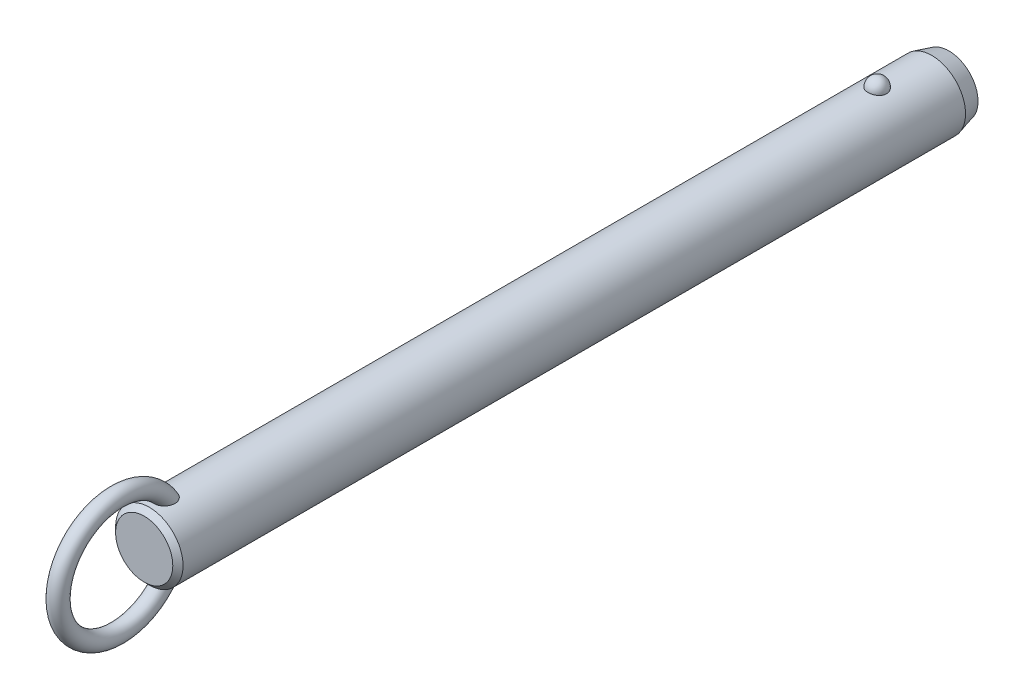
ISO-10303-21;
HEADER;
FILE_DESCRIPTION(('STEP AP214'),'2;1');
FILE_NAME('part.step','',(''),(''),'','','');
FILE_SCHEMA(('AUTOMOTIVE_DESIGN { 1 0 10303 214 1 1 1 1 }'));
ENDSEC;
DATA;
#1=APPLICATION_CONTEXT('core data for automotive mechanical design processes');
#2=APPLICATION_PROTOCOL_DEFINITION('international standard','automotive_design',2000,#1);
#3=PRODUCT_CONTEXT('',#1,'mechanical');
#4=PRODUCT('Part','Part','',(#3));
#5=PRODUCT_RELATED_PRODUCT_CATEGORY('part','',(#4));
#6=PRODUCT_DEFINITION_FORMATION('','',#4);
#7=PRODUCT_DEFINITION_CONTEXT('part definition',#1,'design');
#8=PRODUCT_DEFINITION('design','',#6,#7);
#9=PRODUCT_DEFINITION_SHAPE('','',#8);
#10=(LENGTH_UNIT() NAMED_UNIT(*) SI_UNIT(.MILLI.,.METRE.));
#11=(NAMED_UNIT(*) PLANE_ANGLE_UNIT() SI_UNIT($,.RADIAN.));
#12=(NAMED_UNIT(*) SI_UNIT($,.STERADIAN.) SOLID_ANGLE_UNIT());
#13=UNCERTAINTY_MEASURE_WITH_UNIT(LENGTH_MEASURE(1.E-05),#10,'distance_accuracy_value','');
#14=(GEOMETRIC_REPRESENTATION_CONTEXT(3) GLOBAL_UNCERTAINTY_ASSIGNED_CONTEXT((#13)) GLOBAL_UNIT_ASSIGNED_CONTEXT((#10,
#11,#12)) REPRESENTATION_CONTEXT('',''));
#15=CARTESIAN_POINT('',(0.,0.,0.));
#16=DIRECTION('',(0.,0.,1.));
#17=DIRECTION('',(1.,0.,0.));
#18=AXIS2_PLACEMENT_3D('',#15,#16,#17);
#19=CARTESIAN_POINT('',(0.,0.,160.));
#20=DIRECTION('',(0.,0.,-1.));
#21=DIRECTION('',(-1.,0.,0.));
#22=AXIS2_PLACEMENT_3D('',#19,#20,#21);
#23=CYLINDRICAL_SURFACE('',#22,7.9);
#24=CARTESIAN_POINT('',(2.1785689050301,7.59367088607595,-2.20000000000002));
#25=CARTESIAN_POINT('',(2.17856679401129,7.59367269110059,-2.07701843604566));
#26=CARTESIAN_POINT('',(2.16853481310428,7.59657145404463,-1.95401006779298));
#27=CARTESIAN_POINT('',(2.12864689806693,7.607843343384,-1.71147811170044));
#28=CARTESIAN_POINT('',(2.09878338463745,7.61621856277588,-1.5919558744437));
#29=CARTESIAN_POINT('',(2.0199931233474,7.63749180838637,-1.35985638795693));
#30=CARTESIAN_POINT('',(1.97107475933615,7.6503878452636,-1.24727610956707));
#31=CARTESIAN_POINT('',(1.85539377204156,7.67926115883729,-1.03213234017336));
#32=CARTESIAN_POINT('',(1.78863158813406,7.69523835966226,-0.929568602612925));
#33=CARTESIAN_POINT('',(1.63856494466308,7.7285848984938,-0.73678633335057));
#34=CARTESIAN_POINT('',(1.55518140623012,7.7459606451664,-0.646630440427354));
#35=CARTESIAN_POINT('',(1.37422937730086,7.78009978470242,-0.481747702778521));
#36=CARTESIAN_POINT('',(1.27666086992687,7.79686317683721,-0.407020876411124));
#37=CARTESIAN_POINT('',(1.07024728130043,7.82786153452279,-0.275278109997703));
#38=CARTESIAN_POINT('',(0.961434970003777,7.84210353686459,-0.218212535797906));
#39=CARTESIAN_POINT('',(0.735351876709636,7.86652194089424,-0.123146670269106));
#40=CARTESIAN_POINT('',(0.618082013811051,7.87669878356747,-0.0851443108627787));
#41=CARTESIAN_POINT('',(0.380637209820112,7.89170521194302,-0.0298158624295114));
#42=CARTESIAN_POINT('',(0.260550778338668,7.89662650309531,-0.0121347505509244));
#43=CARTESIAN_POINT('',(0.0190117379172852,7.90090003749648,0.00324379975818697));
#44=CARTESIAN_POINT('',(-0.102440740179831,7.90025280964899,0.000943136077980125));
#45=CARTESIAN_POINT('',(-0.341452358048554,7.89351056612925,-0.0233955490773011));
#46=CARTESIAN_POINT('',(-0.459042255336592,7.88749257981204,-0.0451545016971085));
#47=CARTESIAN_POINT('',(-0.688796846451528,7.87075812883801,-0.107408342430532));
#48=CARTESIAN_POINT('',(-0.800961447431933,7.86004158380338,-0.14790355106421));
#49=CARTESIAN_POINT('',(-1.01743634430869,7.83497131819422,-0.246799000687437));
#50=CARTESIAN_POINT('',(-1.12169791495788,7.82059709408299,-0.305300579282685));
#51=CARTESIAN_POINT('',(-1.31891765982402,7.78976470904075,-0.43854939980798));
#52=CARTESIAN_POINT('',(-1.41187469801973,7.77330633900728,-0.513298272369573));
#53=CARTESIAN_POINT('',(-1.58577142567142,7.73972434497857,-0.678622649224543));
#54=CARTESIAN_POINT('',(-1.66645140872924,7.72259402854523,-0.769470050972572));
#55=CARTESIAN_POINT('',(-1.81161503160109,7.68983776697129,-0.963538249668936));
#56=CARTESIAN_POINT('',(-1.87609753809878,7.6742119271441,-1.0667599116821));
#57=CARTESIAN_POINT('',(-1.98790138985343,7.6460202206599,-1.28401170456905));
#58=CARTESIAN_POINT('',(-2.03501994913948,7.63349104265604,-1.39815107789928));
#59=CARTESIAN_POINT('',(-2.10986724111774,7.6131449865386,-1.6330178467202));
#60=CARTESIAN_POINT('',(-2.1375965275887,7.60532797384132,-1.75374505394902));
#61=CARTESIAN_POINT('',(-2.17289256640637,7.5953195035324,-1.99782562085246));
#62=CARTESIAN_POINT('',(-2.18054294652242,7.59310471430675,-2.12116592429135));
#63=CARTESIAN_POINT('',(-2.17572919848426,7.59448538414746,-2.36741799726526));
#64=CARTESIAN_POINT('',(-2.1632656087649,7.59808068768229,-2.49032977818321));
#65=CARTESIAN_POINT('',(-2.11865035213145,7.61064035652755,-2.73161015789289));
#66=CARTESIAN_POINT('',(-2.08659579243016,7.61957823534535,-2.84999812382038));
#67=CARTESIAN_POINT('',(-2.00367799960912,7.64179982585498,-3.07955956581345));
#68=CARTESIAN_POINT('',(-1.9528140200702,7.65508371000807,-3.19073275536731));
#69=CARTESIAN_POINT('',(-1.83321113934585,7.68460381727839,-3.40337899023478));
#70=CARTESIAN_POINT('',(-1.76437735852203,7.70085556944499,-3.5047965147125));
#71=CARTESIAN_POINT('',(-1.61069526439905,7.73445734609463,-3.69446912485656));
#72=CARTESIAN_POINT('',(-1.52584634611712,7.75180741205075,-3.78272371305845));
#73=CARTESIAN_POINT('',(-1.34198059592,7.78574608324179,-3.94393987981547));
#74=CARTESIAN_POINT('',(-1.24291308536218,7.80233167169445,-4.01684434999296));
#75=CARTESIAN_POINT('',(-1.03352039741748,7.83281625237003,-4.14489386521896));
#76=CARTESIAN_POINT('',(-0.92319600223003,7.84671543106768,-4.20004014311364));
#77=CARTESIAN_POINT('',(-0.695822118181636,7.87011575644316,-4.29042017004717));
#78=CARTESIAN_POINT('',(-0.578872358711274,7.87966903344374,-4.32589112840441));
#79=CARTESIAN_POINT('',(-0.340410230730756,7.8935652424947,-4.37692226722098));
#80=CARTESIAN_POINT('',(-0.218898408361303,7.89790879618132,-4.39248482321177));
#81=CARTESIAN_POINT('',(0.0228107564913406,7.90087453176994,-4.40314405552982));
#82=CARTESIAN_POINT('',(0.142990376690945,7.89960185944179,-4.39861683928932));
#83=CARTESIAN_POINT('',(0.380829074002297,7.89171262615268,-4.37008293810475));
#84=CARTESIAN_POINT('',(0.498488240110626,7.8850962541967,-4.34607694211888));
#85=CARTESIAN_POINT('',(0.727535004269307,7.86726442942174,-4.27939317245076));
#86=CARTESIAN_POINT('',(0.838944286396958,7.85606616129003,-4.23678512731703));
#87=CARTESIAN_POINT('',(1.05295421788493,7.83025654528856,-4.13408348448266));
#88=CARTESIAN_POINT('',(1.15555431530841,7.81564498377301,-4.07398879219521));
#89=CARTESIAN_POINT('',(1.35076763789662,7.7843022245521,-3.93687432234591));
#90=CARTESIAN_POINT('',(1.4432046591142,7.76754209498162,-3.85961036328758));
#91=CARTESIAN_POINT('',(1.6139111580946,7.73387857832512,-3.69076949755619));
#92=CARTESIAN_POINT('',(1.6921781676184,7.71697516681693,-3.59919010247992));
#93=CARTESIAN_POINT('',(1.83380875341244,7.6845643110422,-3.40247278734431));
#94=CARTESIAN_POINT('',(1.89689280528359,7.66908588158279,-3.29712873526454));
#95=CARTESIAN_POINT('',(2.0047823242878,7.64159441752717,-3.07707931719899));
#96=CARTESIAN_POINT('',(2.0495945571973,7.62958010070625,-2.96237743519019));
#97=CARTESIAN_POINT('',(2.11580183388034,7.61146617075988,-2.74040519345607));
#98=CARTESIAN_POINT('',(2.13929812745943,7.60484503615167,-2.63379846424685));
#99=CARTESIAN_POINT('',(2.17068242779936,7.59594664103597,-2.4181348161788));
#100=CARTESIAN_POINT('',(2.17857077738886,7.59366928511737,-2.30907795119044));
#101=CARTESIAN_POINT('',(2.1785689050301,7.59367088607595,-2.20000000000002));
#102=B_SPLINE_CURVE_WITH_KNOTS('',3,(#24,#25,#26,#27,#28,#29,#30,#31,#32,#33,#34,#35,#36,#37,
#38,#39,#40,#41,#42,#43,#44,#45,#46,#47,#48,#49,#50,#51,#52,#53,#54,#55,#56,#57,#58,#59,#60,#61,
#62,#63,#64,#65,#66,#67,#68,#69,#70,#71,#72,#73,#74,#75,#76,#77,#78,#79,#80,#81,#82,#83,#84,#85,
#86,#87,#88,#89,#90,#91,#92,#93,#94,#95,#96,#97,#98,#99,#100,#101),.UNSPECIFIED.,.T.,.F.,(4,2,2,
2,2,2,2,2,2,2,2,2,2,2,2,2,2,2,2,2,2,2,2,2,2,2,2,2,2,2,2,2,2,2,2,2,2,2,4),(0.,0.368552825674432,
0.737246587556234,1.10577831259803,1.4743009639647,1.8446206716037,2.21494081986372,
2.5842105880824,2.95344028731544,3.31611630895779,3.67875788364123,4.03628044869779,
4.39380913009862,4.75338791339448,5.11300280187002,5.47939989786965,5.8458226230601,
6.21639834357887,6.58696347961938,6.95598276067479,7.32499216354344,7.69218715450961,
8.0593967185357,8.42858578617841,8.79778880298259,9.16834203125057,9.5388695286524,
9.90482699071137,10.2707407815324,10.6298333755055,10.9889132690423,11.3466585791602,
11.7044262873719,12.0676511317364,12.4309391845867,12.8004764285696,13.1698767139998,
13.4967701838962,13.8236564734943),.UNSPECIFIED.);
#103=CARTESIAN_POINT('',(2.1785689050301,7.59367088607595,-2.20000000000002));
#104=VERTEX_POINT('',#103);
#105=EDGE_CURVE('E41',#104,#104,#102,.T.);
#106=ORIENTED_EDGE('',*,*,#105,.T.);
#107=EDGE_LOOP('',(#106));
#108=FACE_BOUND('',#107,.T.);
#109=CARTESIAN_POINT('',(0.,0.,168.32));
#110=DIRECTION('',(0.,0.,1.));
#111=DIRECTION('',(1.,0.,0.));
#112=AXIS2_PLACEMENT_3D('',#109,#110,#111);
#113=CIRCLE('',#112,7.9);
#114=CARTESIAN_POINT('',(7.9,0.,168.32));
#115=VERTEX_POINT('',#114);
#116=EDGE_CURVE('E10',#115,#115,#113,.F.);
#117=ORIENTED_EDGE('',*,*,#116,.T.);
#118=EDGE_LOOP('',(#117));
#119=FACE_BOUND('',#118,.T.);
#120=CARTESIAN_POINT('',(-0.630969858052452,-7.87476203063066,162.212432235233));
#121=CARTESIAN_POINT('',(-0.734180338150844,-7.86648998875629,162.247285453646));
#122=CARTESIAN_POINT('',(-0.834476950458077,-7.85639291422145,162.290816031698));
#123=CARTESIAN_POINT('',(-1.0262035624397,-7.83366343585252,162.394094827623));
#124=CARTESIAN_POINT('',(-1.1176141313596,-7.82102565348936,162.453877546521));
#125=CARTESIAN_POINT('',(-1.28877277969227,-7.79464922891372,162.587839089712));
#126=CARTESIAN_POINT('',(-1.36854014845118,-7.78091246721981,162.661993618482));
#127=CARTESIAN_POINT('',(-1.51461521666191,-7.75380398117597,162.822494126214));
#128=CARTESIAN_POINT('',(-1.58092966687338,-7.74043207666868,162.908833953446));
#129=CARTESIAN_POINT('',(-1.70019064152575,-7.7151252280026,163.092978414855));
#130=CARTESIAN_POINT('',(-1.75284037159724,-7.70322473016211,163.190979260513));
#131=CARTESIAN_POINT('',(-1.84263464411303,-7.68224112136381,163.394102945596));
#132=CARTESIAN_POINT('',(-1.87977299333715,-7.6731591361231,163.499228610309));
#133=CARTESIAN_POINT('',(-1.94152728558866,-7.65777930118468,163.723284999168));
#134=CARTESIAN_POINT('',(-1.96475471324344,-7.65179654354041,163.842616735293));
#135=CARTESIAN_POINT('',(-1.99449499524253,-7.64409642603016,164.08342986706));
#136=CARTESIAN_POINT('',(-2.0010005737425,-7.64238092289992,164.204912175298));
#137=CARTESIAN_POINT('',(-1.99856014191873,-7.64302120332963,164.468340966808));
#138=CARTESIAN_POINT('',(-1.98680021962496,-7.64611845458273,164.61025654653));
#139=CARTESIAN_POINT('',(-1.94457772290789,-7.65696186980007,164.891118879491));
#140=CARTESIAN_POINT('',(-1.91409393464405,-7.66471330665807,165.030062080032));
#141=CARTESIAN_POINT('',(-1.82768670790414,-7.68582947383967,165.331939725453));
#142=CARTESIAN_POINT('',(-1.76772963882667,-7.70003779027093,165.493686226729));
#143=CARTESIAN_POINT('',(-1.65998501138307,-7.72371550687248,165.727695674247));
#144=CARTESIAN_POINT('',(-1.62107967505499,-7.73200670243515,165.804297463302));
#145=CARTESIAN_POINT('',(-1.53727726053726,-7.74910377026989,165.954079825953));
#146=CARTESIAN_POINT('',(-1.4923821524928,-7.75790947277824,166.027261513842));
#147=CARTESIAN_POINT('',(-1.37397050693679,-7.77993338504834,166.20288382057));
#148=CARTESIAN_POINT('',(-1.29690364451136,-7.79328473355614,166.302955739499));
#149=CARTESIAN_POINT('',(-1.1288548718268,-7.81939266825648,166.490714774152));
#150=CARTESIAN_POINT('',(-1.0378992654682,-7.83215032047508,166.578424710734));
#151=CARTESIAN_POINT('',(-0.86953281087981,-7.85231710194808,166.713414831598));
#152=CARTESIAN_POINT('',(-0.795716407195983,-7.86021093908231,166.765076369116));
#153=CARTESIAN_POINT('',(-0.640813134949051,-7.87434920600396,166.856381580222));
#154=CARTESIAN_POINT('',(-0.559737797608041,-7.88059619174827,166.89604389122));
#155=CARTESIAN_POINT('',(-0.406456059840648,-7.88984116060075,166.954300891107));
#156=CARTESIAN_POINT('',(-0.335227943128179,-7.89321892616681,166.975384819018));
#157=CARTESIAN_POINT('',(-0.190193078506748,-7.89804235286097,167.00541418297));
#158=CARTESIAN_POINT('',(-0.11638863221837,-7.89948969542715,167.014370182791));
#159=CARTESIAN_POINT('',(0.0318414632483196,-7.90028409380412,167.019291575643));
#160=CARTESIAN_POINT('',(0.106268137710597,-7.89962640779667,167.015227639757));
#161=CARTESIAN_POINT('',(0.253290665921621,-7.8962818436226,166.994461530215));
#162=CARTESIAN_POINT('',(0.325885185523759,-7.8935935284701,166.977750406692));
#163=CARTESIAN_POINT('',(0.481441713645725,-7.88577340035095,166.928738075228));
#164=CARTESIAN_POINT('',(0.563611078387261,-7.88026321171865,166.894005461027));
#165=CARTESIAN_POINT('',(0.721129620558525,-7.86741729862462,166.811796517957));
#166=CARTESIAN_POINT('',(0.796466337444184,-7.86007832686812,166.764297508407));
#167=CARTESIAN_POINT('',(0.971456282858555,-7.84073285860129,166.636513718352));
#168=CARTESIAN_POINT('',(1.06719686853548,-7.82809461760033,166.551004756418));
#169=CARTESIAN_POINT('',(1.24418921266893,-7.80192439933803,166.366232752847));
#170=CARTESIAN_POINT('',(1.32540832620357,-7.78839049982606,166.266939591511));
#171=CARTESIAN_POINT('',(1.45199971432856,-7.76559693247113,166.089576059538));
#172=CARTESIAN_POINT('',(1.50085649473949,-7.75626094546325,166.013954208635));
#173=CARTESIAN_POINT('',(1.59197749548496,-7.7380727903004,165.858742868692));
#174=CARTESIAN_POINT('',(1.63423919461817,-7.72922080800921,165.779151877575));
#175=CARTESIAN_POINT('',(1.71222612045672,-7.71231959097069,165.616664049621));
#176=CARTESIAN_POINT('',(1.74794516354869,-7.70427111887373,165.533764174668));
#177=CARTESIAN_POINT('',(1.81270113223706,-7.68929240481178,165.365296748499));
#178=CARTESIAN_POINT('',(1.84173789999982,-7.68236218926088,165.279729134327));
#179=CARTESIAN_POINT('',(1.89322698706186,-7.6698375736,165.10528702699));
#180=CARTESIAN_POINT('',(1.91558744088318,-7.66426199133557,165.016383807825));
#181=CARTESIAN_POINT('',(1.95281367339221,-7.65485915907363,164.836969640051));
#182=CARTESIAN_POINT('',(1.96767946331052,-7.65103190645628,164.746458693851));
#183=CARTESIAN_POINT('',(2.00021456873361,-7.64262981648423,164.473732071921));
#184=CARTESIAN_POINT('',(2.00600691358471,-7.6410871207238,164.289709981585));
#185=CARTESIAN_POINT('',(1.98445334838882,-7.64669564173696,163.976501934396));
#186=CARTESIAN_POINT('',(1.96607186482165,-7.65149688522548,163.846618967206));
#187=CARTESIAN_POINT('',(1.90884967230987,-7.6659762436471,163.591632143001));
#188=CARTESIAN_POINT('',(1.87002101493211,-7.67565148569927,163.466525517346));
#189=CARTESIAN_POINT('',(1.77063986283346,-7.69918471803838,163.22454013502));
#190=CARTESIAN_POINT('',(1.70993724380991,-7.71307150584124,163.107725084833));
#191=CARTESIAN_POINT('',(1.56733070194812,-7.74330306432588,162.888144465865));
#192=CARTESIAN_POINT('',(1.48543692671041,-7.75964665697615,162.785372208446));
#193=CARTESIAN_POINT('',(1.31346177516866,-7.79047523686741,162.609380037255));
#194=CARTESIAN_POINT('',(1.22547278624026,-7.80495298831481,162.534106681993));
#195=CARTESIAN_POINT('',(1.0372435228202,-7.83218597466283,162.400486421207));
#196=CARTESIAN_POINT('',(0.937008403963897,-7.84494192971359,162.342132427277));
#197=CARTESIAN_POINT('',(0.73359933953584,-7.86649045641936,162.247027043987));
#198=CARTESIAN_POINT('',(0.630941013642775,-7.87547134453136,162.209210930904));
#199=CARTESIAN_POINT('',(0.420465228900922,-7.88950708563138,162.151116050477));
#200=CARTESIAN_POINT('',(0.312645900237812,-7.89456050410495,162.13084369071));
#201=CARTESIAN_POINT('',(0.0960869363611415,-7.9001518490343,162.108455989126));
#202=CARTESIAN_POINT('',(-0.012634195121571,-7.90073226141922,162.106169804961));
#203=CARTESIAN_POINT('',(-0.228766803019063,-7.89742350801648,162.119367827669));
#204=CARTESIAN_POINT('',(-0.336180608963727,-7.89354403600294,162.134813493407));
#205=CARTESIAN_POINT('',(-0.473410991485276,-7.88586871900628,162.166217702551));
#206=CARTESIAN_POINT('',(-0.505257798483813,-7.88388984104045,162.174354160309));
#207=CARTESIAN_POINT('',(-0.568481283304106,-7.87958326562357,162.192208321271));
#208=CARTESIAN_POINT('',(-0.599857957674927,-7.87725556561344,162.201926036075));
#209=CARTESIAN_POINT('',(-0.630969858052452,-7.87476203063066,162.212432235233));
#210=B_SPLINE_CURVE_WITH_KNOTS('',3,(#120,#121,#122,#123,#124,#125,#126,#127,#128,#129,#130,
#131,#132,#133,#134,#135,#136,#137,#138,#139,#140,#141,#142,#143,#144,#145,#146,#147,#148,#149,
#150,#151,#152,#153,#154,#155,#156,#157,#158,#159,#160,#161,#162,#163,#164,#165,#166,#167,#168,
#169,#170,#171,#172,#173,#174,#175,#176,#177,#178,#179,#180,#181,#182,#183,#184,#185,#186,#187,
#188,#189,#190,#191,#192,#193,#194,#195,#196,#197,#198,#199,#200,#201,#202,#203,#204,#205,#206,
#207,#208,#209),.UNSPECIFIED.,.T.,.F.,(4,2,2,2,2,2,2,2,2,2,2,2,2,2,2,2,2,2,2,2,2,2,2,2,2,2,2,2,
2,2,2,2,2,2,2,2,2,2,2,2,2,2,2,2,4),(0.,0.327622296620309,0.655945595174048,0.983718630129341,
1.3113267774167,1.64554655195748,1.97989964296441,2.34365728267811,2.70757317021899,
3.13333684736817,3.55958380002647,4.07655306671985,4.33527897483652,4.59391999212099,
4.97382437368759,5.353017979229,5.62348245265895,5.89352465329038,6.11565959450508,
6.33760092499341,6.56004255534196,6.78264174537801,7.0493084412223,7.31645206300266,
7.70130871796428,8.08701995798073,8.35824509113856,8.62957365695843,8.9011573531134,
9.1727474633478,9.44791855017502,9.72308922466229,10.2715298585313,10.6638393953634,
11.0559179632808,11.4507403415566,11.8453740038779,12.1936425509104,12.5417649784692,
12.8695063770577,13.1973674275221,13.5221104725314,13.8461490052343,13.9449071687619,
14.0436660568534),.UNSPECIFIED.);
#211=CARTESIAN_POINT('',(-0.630969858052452,-7.87476203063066,162.212432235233));
#212=VERTEX_POINT('',#211);
#213=EDGE_CURVE('E60',#212,#212,#210,.T.);
#214=ORIENTED_EDGE('',*,*,#213,.T.);
#215=EDGE_LOOP('',(#214));
#216=FACE_BOUND('',#215,.T.);
#217=CARTESIAN_POINT('',(-0.630969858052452,7.87476203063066,162.212432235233));
#218=CARTESIAN_POINT('',(-0.52891882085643,7.88293636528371,162.177979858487));
#219=CARTESIAN_POINT('',(-0.423745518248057,7.88934810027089,162.151915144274));
#220=CARTESIAN_POINT('',(-0.210236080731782,7.8979273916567,162.117282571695));
#221=CARTESIAN_POINT('',(-0.101893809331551,7.90008607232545,162.108751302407));
#222=CARTESIAN_POINT('',(0.11466056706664,7.89990877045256,162.109457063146));
#223=CARTESIAN_POINT('',(0.222872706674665,7.89757640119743,162.11867980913));
#224=CARTESIAN_POINT('',(0.436107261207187,7.88867538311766,162.154652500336));
#225=CARTESIAN_POINT('',(0.541131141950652,7.8821087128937,162.18139425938));
#226=CARTESIAN_POINT('',(0.745085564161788,7.86545130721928,162.251756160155));
#227=CARTESIAN_POINT('',(0.844015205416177,7.85536005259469,162.295378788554));
#228=CARTESIAN_POINT('',(1.03299167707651,7.83275153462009,162.398379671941));
#229=CARTESIAN_POINT('',(1.12303841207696,7.8202342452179,162.457758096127));
#230=CARTESIAN_POINT('',(1.29214734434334,7.79408219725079,162.590864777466));
#231=CARTESIAN_POINT('',(1.37116907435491,7.78044359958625,162.664643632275));
#232=CARTESIAN_POINT('',(1.51597677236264,7.75353170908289,162.824235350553));
#233=CARTESIAN_POINT('',(1.58176261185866,7.74025841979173,162.910048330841));
#234=CARTESIAN_POINT('',(1.70057386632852,7.71504069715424,163.093644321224));
#235=CARTESIAN_POINT('',(1.75320073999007,7.7031425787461,163.191690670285));
#236=CARTESIAN_POINT('',(1.8429376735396,7.68216822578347,163.394893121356));
#237=CARTESIAN_POINT('',(1.88004278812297,7.67309289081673,163.500051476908));
#238=CARTESIAN_POINT('',(1.9417232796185,7.6577294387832,163.724167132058));
#239=CARTESIAN_POINT('',(1.96491037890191,7.65175648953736,163.843524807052));
#240=CARTESIAN_POINT('',(1.9945689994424,7.64407702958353,164.084384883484));
#241=CARTESIAN_POINT('',(2.00103304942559,7.64237242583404,164.20588821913));
#242=CARTESIAN_POINT('',(1.99850166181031,7.64303650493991,164.469368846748));
#243=CARTESIAN_POINT('',(1.98669038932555,7.64614714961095,164.611314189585));
#244=CARTESIAN_POINT('',(1.94436120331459,7.6570170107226,164.892228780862));
#245=CARTESIAN_POINT('',(1.91382203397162,7.66478150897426,165.031194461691));
#246=CARTESIAN_POINT('',(1.82728754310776,7.68592483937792,165.333111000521));
#247=CARTESIAN_POINT('',(1.76725778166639,7.7001468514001,165.494872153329));
#248=CARTESIAN_POINT('',(1.65939700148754,7.72384204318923,165.728891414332));
#249=CARTESIAN_POINT('',(1.62045187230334,7.73213852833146,165.805494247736));
#250=CARTESIAN_POINT('',(1.53656684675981,7.74924489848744,165.955273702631));
#251=CARTESIAN_POINT('',(1.49162892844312,7.75805461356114,166.028451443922));
#252=CARTESIAN_POINT('',(1.37317698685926,7.78007342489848,166.203952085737));
#253=CARTESIAN_POINT('',(1.29612360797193,7.79341423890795,166.303911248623));
#254=CARTESIAN_POINT('',(1.12812043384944,7.81949839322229,166.49145083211));
#255=CARTESIAN_POINT('',(1.03719688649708,7.83224280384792,166.579054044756));
#256=CARTESIAN_POINT('',(0.868871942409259,7.85239026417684,166.71389715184));
#257=CARTESIAN_POINT('',(0.795056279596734,7.86027769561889,166.765511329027));
#258=CARTESIAN_POINT('',(0.640160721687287,7.87440222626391,166.856720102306));
#259=CARTESIAN_POINT('',(0.559092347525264,7.88064188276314,166.896333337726));
#260=CARTESIAN_POINT('',(0.405820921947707,7.8898738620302,166.954505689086));
#261=CARTESIAN_POINT('',(0.334594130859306,7.89324577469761,166.975552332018));
#262=CARTESIAN_POINT('',(0.189568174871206,7.89805733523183,167.005507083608));
#263=CARTESIAN_POINT('',(0.115771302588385,7.89949866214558,167.014425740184));
#264=CARTESIAN_POINT('',(-0.0324359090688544,7.90028156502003,167.01927589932));
#265=CARTESIAN_POINT('',(-0.106847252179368,7.89961843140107,167.015178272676));
#266=CARTESIAN_POINT('',(-0.253834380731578,7.8962642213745,166.994351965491));
#267=CARTESIAN_POINT('',(-0.326408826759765,7.89357170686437,166.977614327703));
#268=CARTESIAN_POINT('',(-0.481962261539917,7.88574179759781,166.928539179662));
#269=CARTESIAN_POINT('',(-0.564145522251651,7.88022507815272,166.893763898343));
#270=CARTESIAN_POINT('',(-0.7216852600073,7.86736646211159,166.811468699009));
#271=CARTESIAN_POINT('',(-0.797029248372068,7.8600213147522,166.763926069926));
#272=CARTESIAN_POINT('',(-0.972044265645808,7.84066026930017,166.636026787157));
#273=CARTESIAN_POINT('',(-1.06779803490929,7.828012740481,166.550443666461));
#274=CARTESIAN_POINT('',(-1.24480531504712,7.80182621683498,166.365522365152));
#275=CARTESIAN_POINT('',(-1.32602618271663,7.78828530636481,166.266154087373));
#276=CARTESIAN_POINT('',(-1.4525983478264,7.76548487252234,166.088680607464));
#277=CARTESIAN_POINT('',(-1.50143856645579,7.75614818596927,166.013025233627));
#278=CARTESIAN_POINT('',(-1.59252410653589,7.73796020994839,165.857748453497));
#279=CARTESIAN_POINT('',(-1.63476690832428,7.729109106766,165.778125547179));
#280=CARTESIAN_POINT('',(-1.7127131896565,7.71221133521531,165.615575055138));
#281=CARTESIAN_POINT('',(-1.74841047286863,7.70416543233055,165.532644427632));
#282=CARTESIAN_POINT('',(-1.81311929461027,7.6891937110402,165.364116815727));
#283=CARTESIAN_POINT('',(-1.84213067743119,7.68226791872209,165.278519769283));
#284=CARTESIAN_POINT('',(-1.89356259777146,7.66975461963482,165.104025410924));
#285=CARTESIAN_POINT('',(-1.91589165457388,7.66418586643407,165.015099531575));
#286=CARTESIAN_POINT('',(-1.9530507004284,7.65479859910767,164.835642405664));
#287=CARTESIAN_POINT('',(-1.96788069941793,7.65098008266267,164.745111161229));
#288=CARTESIAN_POINT('',(-2.00030078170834,7.64260704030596,164.472327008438));
#289=CARTESIAN_POINT('',(-2.00600576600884,7.64108760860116,164.288271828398));
#290=CARTESIAN_POINT('',(-1.9842848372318,7.64673945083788,163.975080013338));
#291=CARTESIAN_POINT('',(-1.96583698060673,7.65155751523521,163.845240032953));
#292=CARTESIAN_POINT('',(-1.90848948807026,7.66606613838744,163.590361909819));
#293=CARTESIAN_POINT('',(-1.86960376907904,7.67575338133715,163.465320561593));
#294=CARTESIAN_POINT('',(-1.77013421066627,7.6993013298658,163.223500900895));
#295=CARTESIAN_POINT('',(-1.70940488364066,7.71318991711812,163.106784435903));
#296=CARTESIAN_POINT('',(-1.5667295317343,7.74342495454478,162.887340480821));
#297=CARTESIAN_POINT('',(-1.48478316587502,7.75977144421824,162.78461321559));
#298=CARTESIAN_POINT('',(-1.31266325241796,7.79061163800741,162.608643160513));
#299=CARTESIAN_POINT('',(-1.22456383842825,7.80509908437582,162.533358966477));
#300=CARTESIAN_POINT('',(-1.03622400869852,7.83231881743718,162.399865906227));
#301=CARTESIAN_POINT('',(-0.93601531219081,7.84505551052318,162.341613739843));
#302=CARTESIAN_POINT('',(-0.798824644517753,7.85957802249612,162.277540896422));
#303=CARTESIAN_POINT('',(-0.765787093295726,7.86286821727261,162.263224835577));
#304=CARTESIAN_POINT('',(-0.698939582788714,7.86909211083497,162.236436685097));
#305=CARTESIAN_POINT('',(-0.665129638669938,7.8720258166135,162.223964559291));
#306=CARTESIAN_POINT('',(-0.630969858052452,7.87476203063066,162.212432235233));
#307=B_SPLINE_CURVE_WITH_KNOTS('',3,(#217,#218,#219,#220,#221,#222,#223,#224,#225,#226,#227,
#228,#229,#230,#231,#232,#233,#234,#235,#236,#237,#238,#239,#240,#241,#242,#243,#244,#245,#246,
#247,#248,#249,#250,#251,#252,#253,#254,#255,#256,#257,#258,#259,#260,#261,#262,#263,#264,#265,
#266,#267,#268,#269,#270,#271,#272,#273,#274,#275,#276,#277,#278,#279,#280,#281,#282,#283,#284,
#285,#286,#287,#288,#289,#290,#291,#292,#293,#294,#295,#296,#297,#298,#299,#300,#301,#302,#303,
#304,#305,#306),.UNSPECIFIED.,.T.,.F.,(4,2,2,2,2,2,2,2,2,2,2,2,2,2,2,2,2,2,2,2,2,2,2,2,2,2,2,2,
2,2,2,2,2,2,2,2,2,2,2,2,2,2,2,2,4),(0.,0.32392037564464,0.648516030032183,0.972850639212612,
1.29703380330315,1.62126473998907,1.94549915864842,2.27089401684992,2.59629203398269,
2.93059633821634,3.26500707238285,3.6288164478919,3.99278833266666,4.41865421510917,
4.84500434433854,5.36209210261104,5.62087589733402,5.87957448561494,6.25918598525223,
6.63808782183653,6.90846748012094,7.17842501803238,7.40052350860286,7.6224287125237,
7.84483086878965,8.0673907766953,8.33414615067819,8.60137921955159,8.98641454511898,
9.37230415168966,9.64358673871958,9.91497268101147,10.1866142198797,10.4582620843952,
10.7334745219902,11.008686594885,11.5572126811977,11.9494246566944,12.3413699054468,
12.7359755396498,13.1305875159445,13.4791770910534,13.82687259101,13.9353013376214,
14.0437279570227),.UNSPECIFIED.);
#308=CARTESIAN_POINT('',(-0.630969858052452,7.87476203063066,162.212432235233));
#309=VERTEX_POINT('',#308);
#310=EDGE_CURVE('E67',#309,#309,#307,.T.);
#311=ORIENTED_EDGE('',*,*,#310,.T.);
#312=EDGE_LOOP('',(#311));
#313=FACE_BOUND('',#312,.T.);
#314=CARTESIAN_POINT('',(0.,0.,-15.));
#315=DIRECTION('',(0.,0.,-1.));
#316=DIRECTION('',(-1.,0.,0.));
#317=AXIS2_PLACEMENT_3D('',#314,#315,#316);
#318=CIRCLE('',#317,7.9);
#319=CARTESIAN_POINT('',(-7.9,0.,-15.));
#320=VERTEX_POINT('',#319);
#321=EDGE_CURVE('E57',#320,#320,#318,.F.);
#322=ORIENTED_EDGE('',*,*,#321,.T.);
#323=EDGE_LOOP('',(#322));
#324=FACE_BOUND('',#323,.T.);
#325=ADVANCED_FACE('F37',(#108,#119,#216,#313,#324),#23,.T.);
#326=CARTESIAN_POINT('',(0.,0.,-19.));
#327=DIRECTION('',(0.,0.,-1.));
#328=DIRECTION('',(-1.,0.,0.));
#329=AXIS2_PLACEMENT_3D('',#326,#327,#328);
#330=PLANE('',#329);
#331=CARTESIAN_POINT('',(0.,0.,-19.));
#332=DIRECTION('',(0.,0.,-1.));
#333=DIRECTION('',(-1.,0.,0.));
#334=AXIS2_PLACEMENT_3D('',#331,#332,#333);
#335=CIRCLE('',#334,6.82820323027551);
#336=CARTESIAN_POINT('',(-6.82820323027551,0.,-19.));
#337=VERTEX_POINT('',#336);
#338=EDGE_CURVE('E66',#337,#337,#335,.T.);
#339=ORIENTED_EDGE('',*,*,#338,.T.);
#340=EDGE_LOOP('',(#339));
#341=FACE_BOUND('',#340,.T.);
#342=ADVANCED_FACE('F85',(#341),#330,.T.);
#343=CARTESIAN_POINT('',(0.,0.,-19.));
#344=DIRECTION('',(0.,0.,1.));
#345=DIRECTION('',(1.,0.,0.));
#346=AXIS2_PLACEMENT_3D('',#343,#344,#345);
#347=CONICAL_SURFACE('',#346,6.82820323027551,0.261799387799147);
#348=ORIENTED_EDGE('',*,*,#321,.F.);
#349=EDGE_LOOP('',(#348));
#350=FACE_BOUND('',#349,.T.);
#351=ORIENTED_EDGE('',*,*,#338,.F.);
#352=EDGE_LOOP('',(#351));
#353=FACE_BOUND('',#352,.T.);
#354=ADVANCED_FACE('F83',(#350,#353),#347,.T.);
#355=CARTESIAN_POINT('',(0.,0.,169.52));
#356=DIRECTION('',(0.,0.,1.));
#357=DIRECTION('',(1.,0.,0.));
#358=AXIS2_PLACEMENT_3D('',#355,#356,#357);
#359=PLANE('',#358);
#360=CARTESIAN_POINT('',(0.,0.,169.52));
#361=DIRECTION('',(0.,0.,1.));
#362=DIRECTION('',(1.,0.,0.));
#363=AXIS2_PLACEMENT_3D('',#360,#361,#362);
#364=CIRCLE('',#363,6.69999999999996);
#365=CARTESIAN_POINT('',(6.69999999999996,0.,169.52));
#366=VERTEX_POINT('',#365);
#367=EDGE_CURVE('E50',#366,#366,#364,.T.);
#368=ORIENTED_EDGE('',*,*,#367,.T.);
#369=EDGE_LOOP('',(#368));
#370=FACE_BOUND('',#369,.T.);
#371=ADVANCED_FACE('F77',(#370),#359,.T.);
#372=CARTESIAN_POINT('',(0.,0.,175.85));
#373=DIRECTION('',(1.,0.,0.));
#374=DIRECTION('',(0.,0.,-1.));
#375=AXIS2_PLACEMENT_3D('',#372,#373,#374);
#376=TOROIDAL_SURFACE('',#375,13.85,2.);
#377=ORIENTED_EDGE('',*,*,#310,.F.);
#378=EDGE_LOOP('',(#377));
#379=FACE_BOUND('',#378,.T.);
#380=ORIENTED_EDGE('',*,*,#213,.F.);
#381=EDGE_LOOP('',(#380));
#382=FACE_BOUND('',#381,.T.);
#383=ADVANCED_FACE('F73',(#379,#382),#376,.T.);
#384=CARTESIAN_POINT('',(0.,0.,169.52));
#385=DIRECTION('',(0.,0.,-1.));
#386=DIRECTION('',(-1.,0.,0.));
#387=AXIS2_PLACEMENT_3D('',#384,#385,#386);
#388=CONICAL_SURFACE('',#387,6.69999999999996,0.785398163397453);
#389=ORIENTED_EDGE('',*,*,#116,.F.);
#390=EDGE_LOOP('',(#389));
#391=FACE_BOUND('',#390,.T.);
#392=ORIENTED_EDGE('',*,*,#367,.F.);
#393=EDGE_LOOP('',(#392));
#394=FACE_BOUND('',#393,.T.);
#395=ADVANCED_FACE('F39',(#391,#394),#388,.T.);
#396=CARTESIAN_POINT('',(0.,7.9,-2.20000000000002));
#397=DIRECTION('',(0.,1.,0.));
#398=DIRECTION('',(0.,0.,-1.));
#399=AXIS2_PLACEMENT_3D('',#396,#397,#398);
#400=SPHERICAL_SURFACE('',#399,2.2);
#401=ORIENTED_EDGE('',*,*,#105,.F.);
#402=EDGE_LOOP('',(#401));
#403=FACE_BOUND('',#402,.T.);
#404=ADVANCED_FACE('F79',(#403),#400,.T.);
#405=CLOSED_SHELL('',(#325,#342,#354,#371,#383,#395,#404));
#406=MANIFOLD_SOLID_BREP('B2',#405);
#407=ADVANCED_BREP_SHAPE_REPRESENTATION('',(#18,#406),#14);
#408=SHAPE_DEFINITION_REPRESENTATION(#9,#407);
ENDSEC;
END-ISO-10303-21;
